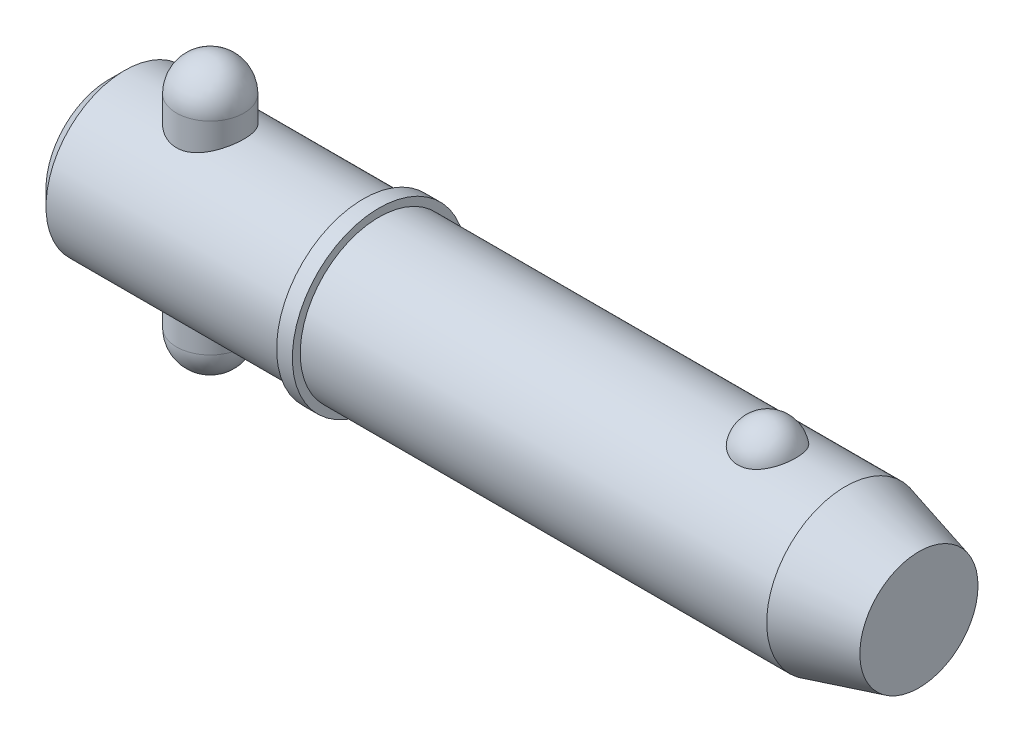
ISO-10303-21;
HEADER;
FILE_DESCRIPTION(('STEP AP214'),'2;1');
FILE_NAME('part.step','',(''),(''),'','','');
FILE_SCHEMA(('AUTOMOTIVE_DESIGN { 1 0 10303 214 1 1 1 1 }'));
ENDSEC;
DATA;
#1=APPLICATION_CONTEXT('core data for automotive mechanical design processes');
#2=APPLICATION_PROTOCOL_DEFINITION('international standard','automotive_design',2000,#1);
#3=PRODUCT_CONTEXT('',#1,'mechanical');
#4=PRODUCT('Part','Part','',(#3));
#5=PRODUCT_RELATED_PRODUCT_CATEGORY('part','',(#4));
#6=PRODUCT_DEFINITION_FORMATION('','',#4);
#7=PRODUCT_DEFINITION_CONTEXT('part definition',#1,'design');
#8=PRODUCT_DEFINITION('design','',#6,#7);
#9=PRODUCT_DEFINITION_SHAPE('','',#8);
#10=(LENGTH_UNIT() NAMED_UNIT(*) SI_UNIT(.MILLI.,.METRE.));
#11=(NAMED_UNIT(*) PLANE_ANGLE_UNIT() SI_UNIT($,.RADIAN.));
#12=(NAMED_UNIT(*) SI_UNIT($,.STERADIAN.) SOLID_ANGLE_UNIT());
#13=UNCERTAINTY_MEASURE_WITH_UNIT(LENGTH_MEASURE(1.E-05),#10,'distance_accuracy_value','');
#14=(GEOMETRIC_REPRESENTATION_CONTEXT(3) GLOBAL_UNCERTAINTY_ASSIGNED_CONTEXT((#13)) GLOBAL_UNIT_ASSIGNED_CONTEXT((#10,
#11,#12)) REPRESENTATION_CONTEXT('',''));
#15=CARTESIAN_POINT('',(0.,0.,0.));
#16=DIRECTION('',(0.,0.,1.));
#17=DIRECTION('',(1.,0.,0.));
#18=AXIS2_PLACEMENT_3D('',#15,#16,#17);
#19=CARTESIAN_POINT('',(14.28,19.05,0.));
#20=DIRECTION('',(0.,-1.,0.));
#21=DIRECTION('',(0.,0.,-1.));
#22=AXIS2_PLACEMENT_3D('',#19,#20,#21);
#23=CYLINDRICAL_SURFACE('',#22,4.76);
#24=CARTESIAN_POINT('',(14.28,-14.29,0.));
#25=DIRECTION('',(0.,-1.,0.));
#26=DIRECTION('',(0.,0.,-1.));
#27=AXIS2_PLACEMENT_3D('',#24,#25,#26);
#28=CIRCLE('',#27,4.76);
#29=CARTESIAN_POINT('',(14.28,-14.29,-4.76));
#30=VERTEX_POINT('',#29);
#31=EDGE_CURVE('P0_E10',#30,#30,#28,.F.);
#32=CARTESIAN_POINT('',(14.28,14.29,0.));
#33=DIRECTION('',(0.,-1.,0.));
#34=DIRECTION('',(0.,0.,-1.));
#35=AXIS2_PLACEMENT_3D('',#32,#33,#34);
#36=CIRCLE('',#35,4.76);
#37=CARTESIAN_POINT('',(14.28,14.29,-4.76));
#38=VERTEX_POINT('',#37);
#39=EDGE_CURVE('P0_E21',#38,#38,#36,.T.);
#40=CARTESIAN_POINT('',(14.28,-14.29,-4.76));
#41=CARTESIAN_POINT('',(14.28,-13.9922916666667,-4.76));
#42=CARTESIAN_POINT('',(14.28,-13.6945833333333,-4.76));
#43=CARTESIAN_POINT('',(14.28,-13.0991666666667,-4.76));
#44=CARTESIAN_POINT('',(14.28,-12.8014583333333,-4.76));
#45=CARTESIAN_POINT('',(14.28,-12.2060416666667,-4.76));
#46=CARTESIAN_POINT('',(14.28,-11.9083333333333,-4.76));
#47=CARTESIAN_POINT('',(14.28,-11.3129166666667,-4.76));
#48=CARTESIAN_POINT('',(14.28,-11.0152083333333,-4.76));
#49=CARTESIAN_POINT('',(14.28,-10.4197916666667,-4.76));
#50=CARTESIAN_POINT('',(14.28,-10.1220833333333,-4.76));
#51=CARTESIAN_POINT('',(14.28,-9.52666666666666,-4.76));
#52=CARTESIAN_POINT('',(14.28,-9.22895833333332,-4.76));
#53=CARTESIAN_POINT('',(14.28,-8.63354166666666,-4.76));
#54=CARTESIAN_POINT('',(14.28,-8.33583333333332,-4.76));
#55=CARTESIAN_POINT('',(14.28,-7.74041666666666,-4.76));
#56=CARTESIAN_POINT('',(14.28,-7.44270833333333,-4.76));
#57=CARTESIAN_POINT('',(14.28,-6.84729166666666,-4.76));
#58=CARTESIAN_POINT('',(14.28,-6.54958333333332,-4.76));
#59=CARTESIAN_POINT('',(14.28,-5.95416666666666,-4.76));
#60=CARTESIAN_POINT('',(14.28,-5.65645833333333,-4.76));
#61=CARTESIAN_POINT('',(14.28,-5.06104166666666,-4.76));
#62=CARTESIAN_POINT('',(14.28,-4.76333333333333,-4.76));
#63=CARTESIAN_POINT('',(14.28,-4.16791666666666,-4.76));
#64=CARTESIAN_POINT('',(14.28,-3.87020833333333,-4.76));
#65=CARTESIAN_POINT('',(14.28,-3.27479166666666,-4.76));
#66=CARTESIAN_POINT('',(14.28,-2.97708333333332,-4.76));
#67=CARTESIAN_POINT('',(14.28,-2.38166666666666,-4.76));
#68=CARTESIAN_POINT('',(14.28,-2.08395833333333,-4.76));
#69=CARTESIAN_POINT('',(14.28,-1.48854166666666,-4.76));
#70=CARTESIAN_POINT('',(14.28,-1.19083333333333,-4.76));
#71=CARTESIAN_POINT('',(14.28,-0.595416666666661,-4.76));
#72=CARTESIAN_POINT('',(14.28,-0.297708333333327,-4.76));
#73=CARTESIAN_POINT('',(14.28,0.297708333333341,-4.76));
#74=CARTESIAN_POINT('',(14.28,0.595416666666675,-4.76));
#75=CARTESIAN_POINT('',(14.28,1.19083333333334,-4.76));
#76=CARTESIAN_POINT('',(14.28,1.48854166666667,-4.76));
#77=CARTESIAN_POINT('',(14.28,2.08395833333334,-4.76));
#78=CARTESIAN_POINT('',(14.28,2.38166666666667,-4.76));
#79=CARTESIAN_POINT('',(14.28,2.97708333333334,-4.76));
#80=CARTESIAN_POINT('',(14.28,3.27479166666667,-4.76));
#81=CARTESIAN_POINT('',(14.28,3.87020833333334,-4.76));
#82=CARTESIAN_POINT('',(14.28,4.16791666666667,-4.76));
#83=CARTESIAN_POINT('',(14.28,4.76333333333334,-4.76));
#84=CARTESIAN_POINT('',(14.28,5.06104166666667,-4.76));
#85=CARTESIAN_POINT('',(14.28,5.65645833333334,-4.76));
#86=CARTESIAN_POINT('',(14.28,5.95416666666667,-4.76));
#87=CARTESIAN_POINT('',(14.28,6.54958333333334,-4.76));
#88=CARTESIAN_POINT('',(14.28,6.84729166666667,-4.76));
#89=CARTESIAN_POINT('',(14.28,7.44270833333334,-4.76));
#90=CARTESIAN_POINT('',(14.28,7.74041666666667,-4.76));
#91=CARTESIAN_POINT('',(14.28,8.33583333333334,-4.76));
#92=CARTESIAN_POINT('',(14.28,8.63354166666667,-4.76));
#93=CARTESIAN_POINT('',(14.28,9.22895833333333,-4.76));
#94=CARTESIAN_POINT('',(14.28,9.52666666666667,-4.76));
#95=CARTESIAN_POINT('',(14.28,10.1220833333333,-4.76));
#96=CARTESIAN_POINT('',(14.28,10.4197916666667,-4.76));
#97=CARTESIAN_POINT('',(14.28,11.0152083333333,-4.76));
#98=CARTESIAN_POINT('',(14.28,11.3129166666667,-4.76));
#99=CARTESIAN_POINT('',(14.28,11.9083333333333,-4.76));
#100=CARTESIAN_POINT('',(14.28,12.2060416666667,-4.76));
#101=CARTESIAN_POINT('',(14.28,12.8014583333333,-4.76));
#102=CARTESIAN_POINT('',(14.28,13.0991666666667,-4.76));
#103=CARTESIAN_POINT('',(14.28,13.6945833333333,-4.76));
#104=CARTESIAN_POINT('',(14.28,13.9922916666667,-4.76));
#105=CARTESIAN_POINT('',(14.28,14.29,-4.76));
#106=B_SPLINE_CURVE_WITH_KNOTS('',3,(#40,#41,#42,#43,#44,#45,#46,#47,#48,#49,#50,#51,#52,#53,
#54,#55,#56,#57,#58,#59,#60,#61,#62,#63,#64,#65,#66,#67,#68,#69,#70,#71,#72,#73,#74,#75,#76,#77,
#78,#79,#80,#81,#82,#83,#84,#85,#86,#87,#88,#89,#90,#91,#92,#93,#94,#95,#96,#97,#98,#99,#100,
#101,#102,#103,#104,#105),.UNSPECIFIED.,.F.,.F.,(4,2,2,2,2,2,2,2,2,2,2,2,2,2,2,2,2,2,2,2,2,2,2,
2,2,2,2,2,2,2,2,2,4),(0.,0.893125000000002,1.78625,2.67937499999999,3.5725,4.465625,5.35875,
6.25187499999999,7.145,8.038125,8.93125,9.82437499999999,10.7175,11.610625,12.50375,13.396875,
14.29,15.183125,16.07625,16.969375,17.8625,18.755625,19.64875,20.541875,21.435,22.328125,
23.22125,24.114375,25.0075,25.900625,26.79375,27.686875,28.58),.UNSPECIFIED.);
#107=EDGE_CURVE('P0_BSEAM14',#30,#38,#106,.T.);
#108=ORIENTED_EDGE('',*,*,#31,.T.);
#109=ORIENTED_EDGE('',*,*,#39,.T.);
#110=ORIENTED_EDGE('',*,*,#107,.T.);
#111=ORIENTED_EDGE('',*,*,#107,.F.);
#112=EDGE_LOOP('',(#108,#110,#109,#111));
#113=FACE_BOUND('',#112,.T.);
#114=ADVANCED_FACE('P0_F14',(#113),#23,.T.);
#115=CARTESIAN_POINT('',(14.28,-14.29,0.));
#116=DIRECTION('',(0.,0.,1.));
#117=DIRECTION('',(1.,0.,0.));
#118=AXIS2_PLACEMENT_3D('',#115,#116,#117);
#119=SPHERICAL_SURFACE('',#118,4.76);
#120=CARTESIAN_POINT('',(14.28,-14.29,0.));
#121=DIRECTION('',(0.,-1.,0.));
#122=DIRECTION('',(0.,0.,-1.));
#123=AXIS2_PLACEMENT_3D('',#120,#121,#122);
#124=SPHERICAL_SURFACE('',#123,4.76);
#125=ORIENTED_EDGE('',*,*,#31,.F.);
#126=EDGE_LOOP('',(#125));
#127=FACE_BOUND('',#126,.T.);
#128=ADVANCED_FACE('P0_F29',(#127),#124,.T.);
#129=CARTESIAN_POINT('',(14.28,14.29,0.));
#130=DIRECTION('',(0.,0.,1.));
#131=DIRECTION('',(1.,0.,0.));
#132=AXIS2_PLACEMENT_3D('',#129,#130,#131);
#133=SPHERICAL_SURFACE('',#132,4.76);
#134=CARTESIAN_POINT('',(14.28,14.29,0.));
#135=DIRECTION('',(0.,-1.,0.));
#136=DIRECTION('',(0.,0.,-1.));
#137=AXIS2_PLACEMENT_3D('',#134,#135,#136);
#138=SPHERICAL_SURFACE('',#137,4.76);
#139=ORIENTED_EDGE('',*,*,#39,.F.);
#140=EDGE_LOOP('',(#139));
#141=FACE_BOUND('',#140,.T.);
#142=ADVANCED_FACE('P0_F16',(#141),#138,.T.);
#143=CLOSED_SHELL('',(#114,#128,#142));
#144=MANIFOLD_SOLID_BREP('P0_B1',#143);
#145=CARTESIAN_POINT('',(0.,0.,0.));
#146=DIRECTION('',(1.,0.,0.));
#147=DIRECTION('',(0.,0.,-1.));
#148=AXIS2_PLACEMENT_3D('',#145,#146,#147);
#149=CYLINDRICAL_SURFACE('',#148,11.115);
#150=CARTESIAN_POINT('',(103.929563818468,0.,0.));
#151=DIRECTION('',(1.,0.,0.));
#152=DIRECTION('',(0.,0.,-1.));
#153=AXIS2_PLACEMENT_3D('',#150,#151,#152);
#154=CIRCLE('',#153,11.115);
#155=CARTESIAN_POINT('',(103.929563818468,0.,-11.115));
#156=VERTEX_POINT('',#155);
#157=EDGE_CURVE('P1_E81',#156,#156,#154,.T.);
#158=ORIENTED_EDGE('',*,*,#157,.F.);
#159=EDGE_LOOP('',(#158));
#160=FACE_BOUND('',#159,.T.);
#161=CARTESIAN_POINT('',(38.1,0.,0.));
#162=DIRECTION('',(1.,0.,0.));
#163=DIRECTION('',(0.,0.,-1.));
#164=AXIS2_PLACEMENT_3D('',#161,#162,#163);
#165=CIRCLE('',#164,11.115);
#166=CARTESIAN_POINT('',(38.1,0.,-11.115));
#167=VERTEX_POINT('',#166);
#168=EDGE_CURVE('P1_E85',#167,#167,#165,.T.);
#169=ORIENTED_EDGE('',*,*,#168,.T.);
#170=EDGE_LOOP('',(#169));
#171=FACE_BOUND('',#170,.T.);
#172=CARTESIAN_POINT('',(92.9310680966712,10.3028087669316,4.17077409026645));
#173=CARTESIAN_POINT('',(92.7147756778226,10.3028003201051,4.17078240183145));
#174=CARTESIAN_POINT('',(92.4985488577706,10.3098895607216,4.15340593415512));
#175=CARTESIAN_POINT('',(92.0725408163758,10.3373834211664,4.08449540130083));
#176=CARTESIAN_POINT('',(91.8627577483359,10.3577841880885,4.03297121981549));
#177=CARTESIAN_POINT('',(91.4557825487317,10.4095237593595,3.89746513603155));
#178=CARTESIAN_POINT('',(91.2585726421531,10.4408466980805,3.81353029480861));
#179=CARTESIAN_POINT('',(90.8813382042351,10.5110236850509,3.61560339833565));
#180=CARTESIAN_POINT('',(90.7013171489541,10.5498792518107,3.50160528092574));
#181=CARTESIAN_POINT('',(90.3576842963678,10.6322884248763,3.24292464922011));
#182=CARTESIAN_POINT('',(90.1946861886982,10.6759443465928,3.09746040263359));
#183=CARTESIAN_POINT('',(89.8945911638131,10.7625291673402,2.78171925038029));
#184=CARTESIAN_POINT('',(89.7574990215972,10.8054579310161,2.61143778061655));
#185=CARTESIAN_POINT('',(89.5064084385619,10.8881935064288,2.24226695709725));
#186=CARTESIAN_POINT('',(89.3937105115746,10.9277761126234,2.04244123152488));
#187=CARTESIAN_POINT('',(89.2017771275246,10.997484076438,1.62578254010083));
#188=CARTESIAN_POINT('',(89.1225446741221,11.0276085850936,1.40894804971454));
#189=CARTESIAN_POINT('',(88.9983034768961,11.0756732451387,0.961250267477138));
#190=CARTESIAN_POINT('',(88.953760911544,11.0934470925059,0.730239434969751));
#191=CARTESIAN_POINT('',(88.9015695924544,11.1143331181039,0.263439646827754));
#192=CARTESIAN_POINT('',(88.8939200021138,11.1174456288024,0.0276507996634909));
#193=CARTESIAN_POINT('',(88.9156105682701,11.1087161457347,-0.440729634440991));
#194=CARTESIAN_POINT('',(88.9447624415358,11.0969502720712,-0.673331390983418));
#195=CARTESIAN_POINT('',(89.0391432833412,11.0597872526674,-1.12996621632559));
#196=CARTESIAN_POINT('',(89.1043729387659,11.0343898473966,-1.35399912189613));
#197=CARTESIAN_POINT('',(89.2696984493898,10.972515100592,-1.78750286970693));
#198=CARTESIAN_POINT('',(89.3698386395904,10.9360236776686,-1.99695478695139));
#199=CARTESIAN_POINT('',(89.6029408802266,10.8557595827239,-2.3952066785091));
#200=CARTESIAN_POINT('',(89.7359054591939,10.8119863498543,-2.5840050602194));
#201=CARTESIAN_POINT('',(90.032407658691,10.7216733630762,-2.93635726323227));
#202=CARTESIAN_POINT('',(90.1960565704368,10.675123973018,-3.09981510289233));
#203=CARTESIAN_POINT('',(90.5498601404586,10.5846571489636,-3.39592247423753));
#204=CARTESIAN_POINT('',(90.7400123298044,10.5407394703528,-3.52857487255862));
#205=CARTESIAN_POINT('',(91.1375014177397,10.4616690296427,-3.75646057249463));
#206=CARTESIAN_POINT('',(91.3443670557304,10.4263443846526,-3.85245432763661));
#207=CARTESIAN_POINT('',(91.7729541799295,10.3675574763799,-4.00798747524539));
#208=CARTESIAN_POINT('',(91.994670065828,10.3440907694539,-4.06754052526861));
#209=CARTESIAN_POINT('',(92.4346695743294,10.3128282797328,-4.14614314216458));
#210=CARTESIAN_POINT('',(92.6525654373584,10.3043040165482,-4.1670783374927));
#211=CARTESIAN_POINT('',(93.08894951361,10.3016771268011,-4.17357158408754));
#212=CARTESIAN_POINT('',(93.3074376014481,10.3075716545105,-4.15913661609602));
#213=CARTESIAN_POINT('',(93.7317442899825,10.3326686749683,-4.09636961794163));
#214=CARTESIAN_POINT('',(93.9377458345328,10.3514555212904,-4.0490957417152));
#215=CARTESIAN_POINT('',(94.3385764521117,10.399818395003,-3.92320197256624));
#216=CARTESIAN_POINT('',(94.5334046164,10.4293952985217,-3.84457953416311));
#217=CARTESIAN_POINT('',(94.9111917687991,10.4969600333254,-3.65612410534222));
#218=CARTESIAN_POINT('',(95.0937974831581,10.5351178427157,-3.54564545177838));
#219=CARTESIAN_POINT('',(95.4382040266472,10.6154999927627,-3.29718036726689));
#220=CARTESIAN_POINT('',(95.600000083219,10.657725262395,-3.15918764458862));
#221=CARTESIAN_POINT('',(95.9069596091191,10.744212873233,-2.85163580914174));
#222=CARTESIAN_POINT('',(96.0508919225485,10.7884718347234,-2.68084605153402));
#223=CARTESIAN_POINT('',(96.3092371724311,10.872374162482,-2.3172186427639));
#224=CARTESIAN_POINT('',(96.4236448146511,10.9120167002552,-2.12437704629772));
#225=CARTESIAN_POINT('',(96.6238739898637,10.9838919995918,-1.71516999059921));
#226=CARTESIAN_POINT('',(96.7086617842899,11.0158465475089,-1.49824866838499));
#227=CARTESIAN_POINT('',(96.8426838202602,11.0673523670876,-1.05228572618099));
#228=CARTESIAN_POINT('',(96.8919174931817,11.086903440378,-0.823243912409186));
#229=CARTESIAN_POINT('',(96.9538915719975,11.1116323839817,-0.359087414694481));
#230=CARTESIAN_POINT('',(96.9665662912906,11.1167843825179,-0.123962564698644));
#231=CARTESIAN_POINT('',(96.954973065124,11.1121144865,0.345220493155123));
#232=CARTESIAN_POINT('',(96.9307056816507,11.1022928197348,0.579278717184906));
#233=CARTESIAN_POINT('',(96.8459073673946,11.0687504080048,1.03866534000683));
#234=CARTESIAN_POINT('',(96.7855299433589,11.0450885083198,1.26402641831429));
#235=CARTESIAN_POINT('',(96.6298532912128,10.9863185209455,1.70076772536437));
#236=CARTESIAN_POINT('',(96.534551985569,10.9512097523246,1.91214712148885));
#237=CARTESIAN_POINT('',(96.3103974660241,10.8729733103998,2.31608359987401));
#238=CARTESIAN_POINT('',(96.1813806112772,10.8298068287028,2.50854240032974));
#239=CARTESIAN_POINT('',(95.8927327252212,10.7401896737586,2.86808766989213));
#240=CARTESIAN_POINT('',(95.7331022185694,10.6937390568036,3.03517457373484));
#241=CARTESIAN_POINT('',(95.3875341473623,10.6029321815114,3.33857581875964));
#242=CARTESIAN_POINT('',(95.2017089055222,10.5585680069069,3.47501541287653));
#243=CARTESIAN_POINT('',(94.8078750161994,10.4769321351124,3.71390897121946));
#244=CARTESIAN_POINT('',(94.5998635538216,10.439661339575,3.81635861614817));
#245=CARTESIAN_POINT('',(94.1540666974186,10.3749407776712,3.98910631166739));
#246=CARTESIAN_POINT('',(93.9152342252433,10.3482457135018,4.05700929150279));
#247=CARTESIAN_POINT('',(93.4279254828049,10.312188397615,4.14782844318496));
#248=CARTESIAN_POINT('',(93.1794535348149,10.3028184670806,4.17076454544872));
#249=CARTESIAN_POINT('',(92.9310680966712,10.3028087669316,4.17077409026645));
#250=B_SPLINE_CURVE_WITH_KNOTS('',3,(#172,#173,#174,#175,#176,#177,#178,#179,#180,#181,#182,
#183,#184,#185,#186,#187,#188,#189,#190,#191,#192,#193,#194,#195,#196,#197,#198,#199,#200,#201,
#202,#203,#204,#205,#206,#207,#208,#209,#210,#211,#212,#213,#214,#215,#216,#217,#218,#219,#220,
#221,#222,#223,#224,#225,#226,#227,#228,#229,#230,#231,#232,#233,#234,#235,#236,#237,#238,#239,
#240,#241,#242,#243,#244,#245,#246,#247,#248,#249),.UNSPECIFIED.,.T.,.F.,(4,2,2,2,2,2,2,2,2,2,2,
2,2,2,2,2,2,2,2,2,2,2,2,2,2,2,2,2,2,2,2,2,2,2,2,2,2,2,4),(0.,0.647966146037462,1.29574482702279,
1.94258643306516,2.58955857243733,3.25496465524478,3.92049326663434,4.61566368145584,
5.31089647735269,6.01531821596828,6.71972398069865,7.42054043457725,8.12137023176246,
8.82309331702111,9.52487047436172,10.2292439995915,10.9335519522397,11.6223330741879,
12.3108558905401,12.9647664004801,13.6185478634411,14.2521847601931,14.8858731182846,
15.5334360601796,16.1811472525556,16.8611459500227,17.5412664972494,18.2431855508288,
18.9451158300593,19.6483065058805,20.3514864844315,21.0516982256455,21.7519516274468,
22.4556690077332,23.1593743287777,23.8601491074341,24.5610129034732,25.3054529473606,
26.049562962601),.UNSPECIFIED.);
#251=CARTESIAN_POINT('',(92.9310680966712,10.3028087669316,4.17077409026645));
#252=VERTEX_POINT('',#251);
#253=EDGE_CURVE('P1_E35',#252,#252,#250,.T.);
#254=ORIENTED_EDGE('',*,*,#253,.T.);
#255=EDGE_LOOP('',(#254));
#256=FACE_BOUND('',#255,.T.);
#257=ADVANCED_FACE('P1_F13',(#160,#171,#256),#149,.T.);
#258=CARTESIAN_POINT('',(0.,0.,0.));
#259=DIRECTION('',(-1.,0.,0.));
#260=DIRECTION('',(0.,0.,1.));
#261=AXIS2_PLACEMENT_3D('',#258,#259,#260);
#262=PLANE('',#261);
#263=CARTESIAN_POINT('',(0.,0.,0.));
#264=DIRECTION('',(1.,0.,0.));
#265=DIRECTION('',(0.,0.,-1.));
#266=AXIS2_PLACEMENT_3D('',#263,#264,#265);
#267=CIRCLE('',#266,8.892);
#268=CARTESIAN_POINT('',(0.,0.,-8.892));
#269=VERTEX_POINT('',#268);
#270=EDGE_CURVE('P1_E9',#269,#269,#267,.T.);
#271=ORIENTED_EDGE('',*,*,#270,.F.);
#272=EDGE_LOOP('',(#271));
#273=FACE_BOUND('',#272,.T.);
#274=ADVANCED_FACE('P1_F15',(#273),#262,.T.);
#275=CARTESIAN_POINT('',(2.22299999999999,0.,0.));
#276=DIRECTION('',(1.,0.,0.));
#277=DIRECTION('',(0.,0.,-1.));
#278=AXIS2_PLACEMENT_3D('',#275,#276,#277);
#279=CONICAL_SURFACE('',#278,11.115,0.78539816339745);
#280=ORIENTED_EDGE('',*,*,#270,.T.);
#281=EDGE_LOOP('',(#280));
#282=FACE_BOUND('',#281,.T.);
#283=CARTESIAN_POINT('',(2.22299999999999,0.,0.));
#284=DIRECTION('',(1.,0.,0.));
#285=DIRECTION('',(0.,0.,-1.));
#286=AXIS2_PLACEMENT_3D('',#283,#284,#285);
#287=CIRCLE('',#286,11.115);
#288=CARTESIAN_POINT('',(2.22299999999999,0.,-11.115));
#289=VERTEX_POINT('',#288);
#290=EDGE_CURVE('P1_E26',#289,#289,#287,.T.);
#291=ORIENTED_EDGE('',*,*,#290,.F.);
#292=EDGE_LOOP('',(#291));
#293=FACE_BOUND('',#292,.T.);
#294=ADVANCED_FACE('P1_F77',(#282,#293),#279,.T.);
#295=CARTESIAN_POINT('',(0.,0.,0.));
#296=DIRECTION('',(1.,0.,0.));
#297=DIRECTION('',(0.,0.,-1.));
#298=AXIS2_PLACEMENT_3D('',#295,#296,#297);
#299=CYLINDRICAL_SURFACE('',#298,11.115);
#300=CARTESIAN_POINT('',(14.28,-10.0441836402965,4.76));
#301=CARTESIAN_POINT('',(14.1533731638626,-10.0441846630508,4.75999904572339));
#302=CARTESIAN_POINT('',(14.0267055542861,-10.0465865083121,4.75493985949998));
#303=CARTESIAN_POINT('',(13.774298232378,-10.0561141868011,4.73475585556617));
#304=CARTESIAN_POINT('',(13.6485591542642,-10.0632429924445,4.71962470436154));
#305=CARTESIAN_POINT('',(13.3987500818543,-10.0819979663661,4.67942666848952));
#306=CARTESIAN_POINT('',(13.2746840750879,-10.0936334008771,4.65433930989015));
#307=CARTESIAN_POINT('',(13.0293244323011,-10.1210146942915,4.59449317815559));
#308=CARTESIAN_POINT('',(12.9080319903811,-10.1367622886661,4.55973032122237));
#309=CARTESIAN_POINT('',(12.669614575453,-10.1717810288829,4.48106435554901));
#310=CARTESIAN_POINT('',(12.5524727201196,-10.1910352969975,4.4372048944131));
#311=CARTESIAN_POINT('',(12.3224300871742,-10.2325403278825,4.34063417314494));
#312=CARTESIAN_POINT('',(12.2095309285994,-10.2547922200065,4.28791957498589));
#313=CARTESIAN_POINT('',(11.8782785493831,-10.3250879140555,4.11715127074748));
#314=CARTESIAN_POINT('',(11.6670799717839,-10.3767168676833,3.98637638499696));
#315=CARTESIAN_POINT('',(11.2564039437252,-10.4874309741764,3.68567149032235));
#316=CARTESIAN_POINT('',(11.0583793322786,-10.5467772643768,3.51386978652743));
#317=CARTESIAN_POINT('',(10.6927724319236,-10.6641377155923,3.13969960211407));
#318=CARTESIAN_POINT('',(10.5252022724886,-10.7221513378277,2.93731900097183));
#319=CARTESIAN_POINT('',(10.2965609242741,-10.8050020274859,2.60935726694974));
#320=CARTESIAN_POINT('',(10.2227768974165,-10.8324811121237,2.49310321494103));
#321=CARTESIAN_POINT('',(10.0853380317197,-10.884703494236,2.25418999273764));
#322=CARTESIAN_POINT('',(10.0216789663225,-10.9094479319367,2.13153352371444));
#323=CARTESIAN_POINT('',(9.90506238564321,-10.9554932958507,1.88060370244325));
#324=CARTESIAN_POINT('',(9.85210574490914,-10.9767939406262,1.7523298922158));
#325=CARTESIAN_POINT('',(9.75746464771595,-11.0153112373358,1.49115740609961));
#326=CARTESIAN_POINT('',(9.71577447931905,-11.0325299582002,1.35826111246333));
#327=CARTESIAN_POINT('',(9.64605475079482,-11.0615607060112,1.09614539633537));
#328=CARTESIAN_POINT('',(9.61740732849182,-11.0736151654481,0.96711700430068));
#329=CARTESIAN_POINT('',(9.57092026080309,-11.0932687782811,0.706847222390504));
#330=CARTESIAN_POINT('',(9.55307574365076,-11.1008699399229,0.575606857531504));
#331=CARTESIAN_POINT('',(9.52838640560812,-11.1114054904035,0.31192917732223));
#332=CARTESIAN_POINT('',(9.52153986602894,-11.114340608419,0.179492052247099));
#333=CARTESIAN_POINT('',(9.51892405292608,-11.1154607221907,-0.0855090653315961));
#334=CARTESIAN_POINT('',(9.52315432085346,-11.1136459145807,-0.218073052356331));
#335=CARTESIAN_POINT('',(9.542009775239,-11.1055891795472,-0.473709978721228));
#336=CARTESIAN_POINT('',(9.55594693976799,-11.099640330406,-0.596843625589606));
#337=CARTESIAN_POINT('',(9.59332832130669,-11.0837823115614,-0.841440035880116));
#338=CARTESIAN_POINT('',(9.61677567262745,-11.0738718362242,-0.962902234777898));
#339=CARTESIAN_POINT('',(9.67294089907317,-11.0503378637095,-1.20325684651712));
#340=CARTESIAN_POINT('',(9.70565569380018,-11.0367156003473,-1.32215009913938));
#341=CARTESIAN_POINT('',(9.78005008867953,-11.0060908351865,-1.55666640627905));
#342=CARTESIAN_POINT('',(9.82173311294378,-10.9890870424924,-1.67228819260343));
#343=CARTESIAN_POINT('',(9.96110379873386,-10.9330280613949,-2.01656166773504));
#344=CARTESIAN_POINT('',(10.0722987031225,-10.8892801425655,-2.23915547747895));
#345=CARTESIAN_POINT('',(10.3268588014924,-10.7934745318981,-2.66299199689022));
#346=CARTESIAN_POINT('',(10.4702355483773,-10.7414138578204,-2.86422700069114));
#347=CARTESIAN_POINT('',(10.7973904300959,-10.6296201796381,-3.25557775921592));
#348=CARTESIAN_POINT('',(10.9833705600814,-10.569604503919,-3.443774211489));
#349=CARTESIAN_POINT('',(11.3844486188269,-10.4514707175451,-3.78722133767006));
#350=CARTESIAN_POINT('',(11.5995590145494,-10.3933534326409,-3.94245783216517));
#351=CARTESIAN_POINT('',(11.9444340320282,-10.311516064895,-4.14990014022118));
#352=CARTESIAN_POINT('',(12.0654579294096,-10.2847012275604,-4.21573894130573));
#353=CARTESIAN_POINT('',(12.3132718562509,-10.2342051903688,-4.33688518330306));
#354=CARTESIAN_POINT('',(12.4400593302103,-10.2105226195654,-4.39219723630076));
#355=CARTESIAN_POINT('',(12.6985418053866,-10.1671237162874,-4.49174500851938));
#356=CARTESIAN_POINT('',(12.8302359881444,-10.1474067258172,-4.53598256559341));
#357=CARTESIAN_POINT('',(13.0975061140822,-10.1126841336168,-4.61287629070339));
#358=CARTESIAN_POINT('',(13.233079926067,-10.0976759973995,-4.64553869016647));
#359=CARTESIAN_POINT('',(13.4978553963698,-10.0737863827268,-4.6971059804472));
#360=CARTESIAN_POINT('',(13.6268754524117,-10.0645618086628,-4.716785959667));
#361=CARTESIAN_POINT('',(13.8862990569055,-10.051062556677,-4.74548419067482));
#362=CARTESIAN_POINT('',(14.0167019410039,-10.0467856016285,-4.75450734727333));
#363=CARTESIAN_POINT('',(14.277859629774,-10.0433352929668,-4.76179143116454));
#364=CARTESIAN_POINT('',(14.4086143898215,-10.0441613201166,-4.76005366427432));
#365=CARTESIAN_POINT('',(14.6694025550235,-10.0508838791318,-4.74584231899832));
#366=CARTESIAN_POINT('',(14.7994359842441,-10.0567802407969,-4.73336910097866));
#367=CARTESIAN_POINT('',(15.0487369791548,-10.0728449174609,-4.69907984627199));
#368=CARTESIAN_POINT('',(15.1681238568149,-10.0826872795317,-4.67797462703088));
#369=CARTESIAN_POINT('',(15.4045894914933,-10.1062580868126,-4.62682977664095));
#370=CARTESIAN_POINT('',(15.5216674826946,-10.1199877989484,-4.59678723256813));
#371=CARTESIAN_POINT('',(15.868278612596,-10.1664161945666,-4.49365911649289));
#372=CARTESIAN_POINT('',(16.0933756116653,-10.2043671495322,-4.40754694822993));
#373=CARTESIAN_POINT('',(16.5357981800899,-10.2919879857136,-4.19898201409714));
#374=CARTESIAN_POINT('',(16.7523611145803,-10.3420954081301,-4.07511281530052));
#375=CARTESIAN_POINT('',(17.1627188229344,-10.4477911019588,-3.7959429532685));
#376=CARTESIAN_POINT('',(17.3565033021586,-10.5033818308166,-3.64062816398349));
#377=CARTESIAN_POINT('',(17.7334034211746,-10.6196376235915,-3.28693729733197));
#378=CARTESIAN_POINT('',(17.9141276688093,-10.6803237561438,-3.08599175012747));
#379=CARTESIAN_POINT('',(18.1582189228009,-10.7666348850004,-2.76320365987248));
#380=CARTESIAN_POINT('',(18.2351223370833,-10.7946346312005,-2.65197124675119));
#381=CARTESIAN_POINT('',(18.3793967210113,-10.8483267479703,-2.42297927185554));
#382=CARTESIAN_POINT('',(18.4467718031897,-10.87402011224,-2.30522255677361));
#383=CARTESIAN_POINT('',(18.5717669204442,-10.9225249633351,-2.06324665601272));
#384=CARTESIAN_POINT('',(18.6293326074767,-10.9453202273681,-1.93899615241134));
#385=CARTESIAN_POINT('',(18.73370006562,-10.9872100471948,-1.6855059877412));
#386=CARTESIAN_POINT('',(18.7805065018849,-11.0063062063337,-1.55626851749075));
#387=CARTESIAN_POINT('',(18.8628731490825,-11.0402419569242,-1.29375150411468));
#388=CARTESIAN_POINT('',(18.8984366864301,-11.0550828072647,-1.16047316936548));
#389=CARTESIAN_POINT('',(18.9579183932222,-11.0800638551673,-0.890912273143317));
#390=CARTESIAN_POINT('',(18.9818374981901,-11.0902044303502,-0.75462995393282));
#391=CARTESIAN_POINT('',(19.0164177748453,-11.104911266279,-0.490295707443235));
#392=CARTESIAN_POINT('',(19.027922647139,-11.1098318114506,-0.362373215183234));
#393=CARTESIAN_POINT('',(19.040554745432,-11.1152360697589,-0.105876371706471));
#394=CARTESIAN_POINT('',(19.0416784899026,-11.1157182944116,0.0226981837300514));
#395=CARTESIAN_POINT('',(19.0335275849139,-11.1122291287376,0.27938352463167));
#396=CARTESIAN_POINT('',(19.0242587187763,-11.1082602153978,0.407494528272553));
#397=CARTESIAN_POINT('',(18.9954320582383,-11.0959792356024,0.662388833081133));
#398=CARTESIAN_POINT('',(18.9758704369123,-11.0876655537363,0.789171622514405));
#399=CARTESIAN_POINT('',(18.9276379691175,-11.0673259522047,1.03545890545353));
#400=CARTESIAN_POINT('',(18.8993573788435,-11.0554596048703,1.15505309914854));
#401=CARTESIAN_POINT('',(18.8337694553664,-11.0282166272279,1.39134516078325));
#402=CARTESIAN_POINT('',(18.7964589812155,-11.0128387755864,1.5080420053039));
#403=CARTESIAN_POINT('',(18.671464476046,-10.9619666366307,1.85262797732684));
#404=CARTESIAN_POINT('',(18.5706772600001,-10.9217161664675,2.07521484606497));
#405=CARTESIAN_POINT('',(18.33202463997,-10.8301378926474,2.51061719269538));
#406=CARTESIAN_POINT('',(18.1926775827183,-10.7783885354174,2.72252375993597));
#407=CARTESIAN_POINT('',(17.8829747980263,-10.669863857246,3.12088015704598));
#408=CARTESIAN_POINT('',(17.7126068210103,-10.6130865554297,3.30731987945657));
#409=CARTESIAN_POINT('',(17.3310036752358,-10.495668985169,3.66358491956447));
#410=CARTESIAN_POINT('',(17.1177010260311,-10.4350471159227,3.83122543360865));
#411=CARTESIAN_POINT('',(16.7778915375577,-10.3495418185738,4.05420569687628));
#412=CARTESIAN_POINT('',(16.6612023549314,-10.3219229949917,4.12383380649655));
#413=CARTESIAN_POINT('',(16.4218466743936,-10.2693487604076,4.25306463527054));
#414=CARTESIAN_POINT('',(16.2991829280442,-10.2443921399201,4.31267191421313));
#415=CARTESIAN_POINT('',(16.0488008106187,-10.1979981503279,4.42126071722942));
#416=CARTESIAN_POINT('',(15.9210894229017,-10.1765561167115,4.47025635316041));
#417=CARTESIAN_POINT('',(15.6613937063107,-10.1379191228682,4.55720152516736));
#418=CARTESIAN_POINT('',(15.5294115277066,-10.1207220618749,4.59515652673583));
#419=CARTESIAN_POINT('',(15.2624981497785,-10.091252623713,4.65951684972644));
#420=CARTESIAN_POINT('',(15.1275757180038,-10.0789672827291,4.68595259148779));
#421=CARTESIAN_POINT('',(14.8556442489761,-10.0597530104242,4.72706206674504));
#422=CARTESIAN_POINT('',(14.7186368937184,-10.0528199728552,4.74174481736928));
#423=CARTESIAN_POINT('',(14.5310955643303,-10.047196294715,4.75363843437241));
#424=CARTESIAN_POINT('',(14.48091543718,-10.0460674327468,4.75602323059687));
#425=CARTESIAN_POINT('',(14.3804923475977,-10.044560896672,4.7592042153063));
#426=CARTESIAN_POINT('',(14.3302493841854,-10.0441832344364,4.76000037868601));
#427=CARTESIAN_POINT('',(14.28,-10.0441836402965,4.76));
#428=B_SPLINE_CURVE_WITH_KNOTS('',3,(#300,#301,#302,#303,#304,#305,#306,#307,#308,#309,#310,
#311,#312,#313,#314,#315,#316,#317,#318,#319,#320,#321,#322,#323,#324,#325,#326,#327,#328,#329,
#330,#331,#332,#333,#334,#335,#336,#337,#338,#339,#340,#341,#342,#343,#344,#345,#346,#347,#348,
#349,#350,#351,#352,#353,#354,#355,#356,#357,#358,#359,#360,#361,#362,#363,#364,#365,#366,#367,
#368,#369,#370,#371,#372,#373,#374,#375,#376,#377,#378,#379,#380,#381,#382,#383,#384,#385,#386,
#387,#388,#389,#390,#391,#392,#393,#394,#395,#396,#397,#398,#399,#400,#401,#402,#403,#404,#405,
#406,#407,#408,#409,#410,#411,#412,#413,#414,#415,#416,#417,#418,#419,#420,#421,#422,#423,#424,
#425,#426,#427),.UNSPECIFIED.,.T.,.F.,(4,2,2,2,2,2,2,2,2,2,2,2,2,2,2,2,2,2,2,2,2,2,2,2,2,2,2,2,
2,2,2,2,2,2,2,2,2,2,2,2,2,2,2,2,2,2,2,2,2,2,2,2,2,2,2,2,2,2,2,2,2,2,2,4),(0.,0.379828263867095,
0.759895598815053,1.14074858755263,1.52176256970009,1.90098898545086,2.28035867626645,
3.03818035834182,3.84125131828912,4.6446414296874,5.06541657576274,5.48601561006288,
5.90664899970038,6.3270687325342,6.72470503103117,7.12216187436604,7.51955659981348,
7.91693487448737,8.28868404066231,8.66055582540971,9.03230414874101,9.40419465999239,
10.1585834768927,10.9132435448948,11.7236471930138,12.5343987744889,12.9550196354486,
13.3754557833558,13.7958221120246,14.2159617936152,14.6079540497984,14.9997658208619,
15.3915300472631,15.7832811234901,16.1477615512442,16.512360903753,17.240999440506,
18.0012974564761,18.761937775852,19.5886929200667,20.0025782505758,20.4162843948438,
20.832212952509,21.2479608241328,21.6635855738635,22.0791769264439,22.4642880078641,
22.8495282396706,23.2345541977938,23.6197234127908,23.9896813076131,24.3597680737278,
25.099327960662,25.8726239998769,26.6462260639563,27.4759193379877,27.8914891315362,
28.3068693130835,28.7216936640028,29.1363123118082,29.5498292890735,29.9630287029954,
30.113753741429,30.2644811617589),.UNSPECIFIED.);
#429=CARTESIAN_POINT('',(14.28,-10.0441836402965,4.76));
#430=VERTEX_POINT('',#429);
#431=EDGE_CURVE('P1_E17',#430,#430,#428,.T.);
#432=ORIENTED_EDGE('',*,*,#431,.F.);
#433=EDGE_LOOP('',(#432));
#434=FACE_BOUND('',#433,.T.);
#435=CARTESIAN_POINT('',(14.28,10.0441836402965,4.76));
#436=CARTESIAN_POINT('',(14.4066268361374,10.0441846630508,4.75999904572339));
#437=CARTESIAN_POINT('',(14.5332944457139,10.0465865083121,4.75493985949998));
#438=CARTESIAN_POINT('',(14.785701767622,10.0561141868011,4.73475585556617));
#439=CARTESIAN_POINT('',(14.9114408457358,10.0632429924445,4.71962470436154));
#440=CARTESIAN_POINT('',(15.1612499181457,10.0819979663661,4.67942666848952));
#441=CARTESIAN_POINT('',(15.2853159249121,10.0936334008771,4.65433930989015));
#442=CARTESIAN_POINT('',(15.5306755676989,10.1210146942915,4.59449317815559));
#443=CARTESIAN_POINT('',(15.6519680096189,10.1367622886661,4.55973032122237));
#444=CARTESIAN_POINT('',(15.890385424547,10.1717810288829,4.48106435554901));
#445=CARTESIAN_POINT('',(16.0075272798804,10.1910352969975,4.4372048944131));
#446=CARTESIAN_POINT('',(16.2375699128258,10.2325403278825,4.34063417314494));
#447=CARTESIAN_POINT('',(16.3504690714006,10.2547922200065,4.28791957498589));
#448=CARTESIAN_POINT('',(16.6817214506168,10.3250879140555,4.11715127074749));
#449=CARTESIAN_POINT('',(16.8929200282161,10.3767168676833,3.98637638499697));
#450=CARTESIAN_POINT('',(17.3035960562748,10.4874309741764,3.68567149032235));
#451=CARTESIAN_POINT('',(17.5016206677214,10.5467772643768,3.51386978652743));
#452=CARTESIAN_POINT('',(17.8672275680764,10.6641377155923,3.13969960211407));
#453=CARTESIAN_POINT('',(18.0347977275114,10.7221513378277,2.93731900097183));
#454=CARTESIAN_POINT('',(18.2634390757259,10.8050020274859,2.60935726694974));
#455=CARTESIAN_POINT('',(18.3372231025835,10.8324811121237,2.49310321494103));
#456=CARTESIAN_POINT('',(18.4746619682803,10.884703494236,2.25418999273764));
#457=CARTESIAN_POINT('',(18.5383210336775,10.9094479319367,2.13153352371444));
#458=CARTESIAN_POINT('',(18.6549376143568,10.9554932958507,1.88060370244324));
#459=CARTESIAN_POINT('',(18.7078942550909,10.9767939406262,1.75232989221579));
#460=CARTESIAN_POINT('',(18.8025353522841,11.0153112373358,1.4911574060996));
#461=CARTESIAN_POINT('',(18.844225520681,11.0325299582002,1.35826111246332));
#462=CARTESIAN_POINT('',(18.9139452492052,11.0615607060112,1.09614539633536));
#463=CARTESIAN_POINT('',(18.9425926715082,11.0736151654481,0.967117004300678));
#464=CARTESIAN_POINT('',(18.9890797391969,11.0932687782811,0.706847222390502));
#465=CARTESIAN_POINT('',(19.0069242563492,11.1008699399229,0.575606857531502));
#466=CARTESIAN_POINT('',(19.0316135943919,11.1114054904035,0.311929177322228));
#467=CARTESIAN_POINT('',(19.0384601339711,11.114340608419,0.179492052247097));
#468=CARTESIAN_POINT('',(19.0410759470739,11.1154607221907,-0.0855090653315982));
#469=CARTESIAN_POINT('',(19.0368456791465,11.1136459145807,-0.218073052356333));
#470=CARTESIAN_POINT('',(19.017990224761,11.1055891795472,-0.47370997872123));
#471=CARTESIAN_POINT('',(19.004053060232,11.099640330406,-0.596843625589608));
#472=CARTESIAN_POINT('',(18.9666716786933,11.0837823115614,-0.841440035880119));
#473=CARTESIAN_POINT('',(18.9432243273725,11.0738718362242,-0.9629022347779));
#474=CARTESIAN_POINT('',(18.8870591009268,11.0503378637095,-1.20325684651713));
#475=CARTESIAN_POINT('',(18.8543443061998,11.0367156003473,-1.32215009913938));
#476=CARTESIAN_POINT('',(18.7799499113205,11.0060908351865,-1.55666640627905));
#477=CARTESIAN_POINT('',(18.7382668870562,10.9890870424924,-1.67228819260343));
#478=CARTESIAN_POINT('',(18.5988962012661,10.9330280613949,-2.01656166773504));
#479=CARTESIAN_POINT('',(18.4877012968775,10.8892801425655,-2.23915547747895));
#480=CARTESIAN_POINT('',(18.2331411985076,10.7934745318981,-2.66299199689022));
#481=CARTESIAN_POINT('',(18.0897644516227,10.7414138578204,-2.86422700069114));
#482=CARTESIAN_POINT('',(17.7626095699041,10.6296201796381,-3.25557775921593));
#483=CARTESIAN_POINT('',(17.5766294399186,10.569604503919,-3.443774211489));
#484=CARTESIAN_POINT('',(17.1755513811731,10.4514707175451,-3.78722133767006));
#485=CARTESIAN_POINT('',(16.9604409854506,10.3933534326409,-3.94245783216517));
#486=CARTESIAN_POINT('',(16.6155659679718,10.311516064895,-4.14990014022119));
#487=CARTESIAN_POINT('',(16.4945420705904,10.2847012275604,-4.21573894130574));
#488=CARTESIAN_POINT('',(16.2467281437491,10.2342051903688,-4.33688518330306));
#489=CARTESIAN_POINT('',(16.1199406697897,10.2105226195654,-4.39219723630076));
#490=CARTESIAN_POINT('',(15.8614581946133,10.1671237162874,-4.49174500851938));
#491=CARTESIAN_POINT('',(15.7297640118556,10.1474067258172,-4.53598256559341));
#492=CARTESIAN_POINT('',(15.4624938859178,10.1126841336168,-4.61287629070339));
#493=CARTESIAN_POINT('',(15.326920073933,10.0976759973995,-4.64553869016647));
#494=CARTESIAN_POINT('',(15.0621446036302,10.0737863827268,-4.6971059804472));
#495=CARTESIAN_POINT('',(14.9331245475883,10.0645618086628,-4.716785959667));
#496=CARTESIAN_POINT('',(14.6737009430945,10.051062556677,-4.74548419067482));
#497=CARTESIAN_POINT('',(14.543298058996,10.0467856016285,-4.75450734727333));
#498=CARTESIAN_POINT('',(14.2821403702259,10.0433352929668,-4.76179143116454));
#499=CARTESIAN_POINT('',(14.1513856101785,10.0441613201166,-4.76005366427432));
#500=CARTESIAN_POINT('',(13.8905974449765,10.0508838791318,-4.74584231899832));
#501=CARTESIAN_POINT('',(13.7605640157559,10.0567802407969,-4.73336910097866));
#502=CARTESIAN_POINT('',(13.5112630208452,10.0728449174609,-4.69907984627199));
#503=CARTESIAN_POINT('',(13.3918761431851,10.0826872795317,-4.67797462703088));
#504=CARTESIAN_POINT('',(13.1554105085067,10.1062580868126,-4.62682977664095));
#505=CARTESIAN_POINT('',(13.0383325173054,10.1199877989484,-4.59678723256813));
#506=CARTESIAN_POINT('',(12.691721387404,10.1664161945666,-4.49365911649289));
#507=CARTESIAN_POINT('',(12.4666243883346,10.2043671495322,-4.40754694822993));
#508=CARTESIAN_POINT('',(12.0242018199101,10.2919879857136,-4.19898201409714));
#509=CARTESIAN_POINT('',(11.8076388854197,10.3420954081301,-4.07511281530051));
#510=CARTESIAN_POINT('',(11.3972811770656,10.4477911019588,-3.7959429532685));
#511=CARTESIAN_POINT('',(11.2034966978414,10.5033818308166,-3.64062816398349));
#512=CARTESIAN_POINT('',(10.8265965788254,10.6196376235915,-3.28693729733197));
#513=CARTESIAN_POINT('',(10.6458723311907,10.6803237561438,-3.08599175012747));
#514=CARTESIAN_POINT('',(10.4017810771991,10.7666348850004,-2.76320365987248));
#515=CARTESIAN_POINT('',(10.3248776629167,10.7946346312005,-2.65197124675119));
#516=CARTESIAN_POINT('',(10.1806032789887,10.8483267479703,-2.42297927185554));
#517=CARTESIAN_POINT('',(10.1132281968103,10.87402011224,-2.30522255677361));
#518=CARTESIAN_POINT('',(9.98823307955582,10.9225249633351,-2.06324665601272));
#519=CARTESIAN_POINT('',(9.93066739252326,10.9453202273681,-1.93899615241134));
#520=CARTESIAN_POINT('',(9.82629993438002,10.9872100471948,-1.6855059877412));
#521=CARTESIAN_POINT('',(9.77949349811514,11.0063062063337,-1.55626851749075));
#522=CARTESIAN_POINT('',(9.69712685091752,11.0402419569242,-1.29375150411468));
#523=CARTESIAN_POINT('',(9.66156331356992,11.0550828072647,-1.16047316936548));
#524=CARTESIAN_POINT('',(9.60208160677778,11.0800638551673,-0.890912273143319));
#525=CARTESIAN_POINT('',(9.57816250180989,11.0902044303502,-0.754629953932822));
#526=CARTESIAN_POINT('',(9.54358222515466,11.104911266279,-0.490295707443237));
#527=CARTESIAN_POINT('',(9.53207735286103,11.1098318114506,-0.362373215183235));
#528=CARTESIAN_POINT('',(9.51944525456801,11.1152360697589,-0.105876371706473));
#529=CARTESIAN_POINT('',(9.51832151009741,11.1157182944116,0.0226981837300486));
#530=CARTESIAN_POINT('',(9.52647241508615,11.1122291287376,0.279383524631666));
#531=CARTESIAN_POINT('',(9.53574128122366,11.1082602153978,0.407494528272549));
#532=CARTESIAN_POINT('',(9.5645679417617,11.0959792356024,0.662388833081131));
#533=CARTESIAN_POINT('',(9.58412956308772,11.0876655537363,0.789171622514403));
#534=CARTESIAN_POINT('',(9.63236203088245,11.0673259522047,1.03545890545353));
#535=CARTESIAN_POINT('',(9.66064262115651,11.0554596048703,1.15505309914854));
#536=CARTESIAN_POINT('',(9.72623054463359,11.0282166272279,1.39134516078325));
#537=CARTESIAN_POINT('',(9.76354101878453,11.0128387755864,1.5080420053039));
#538=CARTESIAN_POINT('',(9.88853552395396,10.9619666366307,1.85262797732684));
#539=CARTESIAN_POINT('',(9.98932273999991,10.9217161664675,2.07521484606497));
#540=CARTESIAN_POINT('',(10.22797536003,10.8301378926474,2.51061719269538));
#541=CARTESIAN_POINT('',(10.3673224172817,10.7783885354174,2.72252375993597));
#542=CARTESIAN_POINT('',(10.6770252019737,10.669863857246,3.12088015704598));
#543=CARTESIAN_POINT('',(10.8473931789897,10.6130865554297,3.30731987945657));
#544=CARTESIAN_POINT('',(11.2289963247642,10.495668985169,3.66358491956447));
#545=CARTESIAN_POINT('',(11.4422989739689,10.4350471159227,3.83122543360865));
#546=CARTESIAN_POINT('',(11.7821084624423,10.3495418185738,4.05420569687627));
#547=CARTESIAN_POINT('',(11.8987976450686,10.3219229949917,4.12383380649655));
#548=CARTESIAN_POINT('',(12.1381533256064,10.2693487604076,4.25306463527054));
#549=CARTESIAN_POINT('',(12.2608170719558,10.2443921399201,4.31267191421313));
#550=CARTESIAN_POINT('',(12.5111991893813,10.1979981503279,4.42126071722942));
#551=CARTESIAN_POINT('',(12.6389105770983,10.1765561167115,4.47025635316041));
#552=CARTESIAN_POINT('',(12.8986062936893,10.1379191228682,4.55720152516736));
#553=CARTESIAN_POINT('',(13.0305884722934,10.1207220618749,4.59515652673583));
#554=CARTESIAN_POINT('',(13.2975018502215,10.091252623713,4.65951684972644));
#555=CARTESIAN_POINT('',(13.4324242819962,10.0789672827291,4.68595259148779));
#556=CARTESIAN_POINT('',(13.7043557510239,10.0597530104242,4.72706206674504));
#557=CARTESIAN_POINT('',(13.8413631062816,10.0528199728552,4.74174481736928));
#558=CARTESIAN_POINT('',(14.0289044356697,10.047196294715,4.75363843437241));
#559=CARTESIAN_POINT('',(14.07908456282,10.0460674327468,4.75602323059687));
#560=CARTESIAN_POINT('',(14.1795076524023,10.044560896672,4.7592042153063));
#561=CARTESIAN_POINT('',(14.2297506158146,10.0441832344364,4.76000037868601));
#562=CARTESIAN_POINT('',(14.28,10.0441836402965,4.76));
#563=B_SPLINE_CURVE_WITH_KNOTS('',3,(#435,#436,#437,#438,#439,#440,#441,#442,#443,#444,#445,
#446,#447,#448,#449,#450,#451,#452,#453,#454,#455,#456,#457,#458,#459,#460,#461,#462,#463,#464,
#465,#466,#467,#468,#469,#470,#471,#472,#473,#474,#475,#476,#477,#478,#479,#480,#481,#482,#483,
#484,#485,#486,#487,#488,#489,#490,#491,#492,#493,#494,#495,#496,#497,#498,#499,#500,#501,#502,
#503,#504,#505,#506,#507,#508,#509,#510,#511,#512,#513,#514,#515,#516,#517,#518,#519,#520,#521,
#522,#523,#524,#525,#526,#527,#528,#529,#530,#531,#532,#533,#534,#535,#536,#537,#538,#539,#540,
#541,#542,#543,#544,#545,#546,#547,#548,#549,#550,#551,#552,#553,#554,#555,#556,#557,#558,#559,
#560,#561,#562),.UNSPECIFIED.,.T.,.F.,(4,2,2,2,2,2,2,2,2,2,2,2,2,2,2,2,2,2,2,2,2,2,2,2,2,2,2,2,
2,2,2,2,2,2,2,2,2,2,2,2,2,2,2,2,2,2,2,2,2,2,2,2,2,2,2,2,2,2,2,2,2,2,2,4),(0.,0.379828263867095,
0.759895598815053,1.14074858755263,1.52176256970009,1.90098898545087,2.28035867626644,
3.03818035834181,3.84125131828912,4.6446414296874,5.06541657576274,5.48601561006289,
5.90664899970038,6.3270687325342,6.72470503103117,7.12216187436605,7.51955659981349,
7.91693487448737,8.28868404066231,8.66055582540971,9.03230414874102,9.4041946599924,
10.1585834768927,10.9132435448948,11.7236471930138,12.5343987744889,12.9550196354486,
13.3754557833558,13.7958221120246,14.2159617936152,14.6079540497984,14.9997658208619,
15.3915300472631,15.7832811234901,16.1477615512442,16.512360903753,17.240999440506,
18.0012974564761,18.761937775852,19.5886929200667,20.0025782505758,20.4162843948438,
20.832212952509,21.2479608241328,21.6635855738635,22.0791769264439,22.4642880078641,
22.8495282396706,23.2345541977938,23.6197234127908,23.9896813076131,24.3597680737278,
25.099327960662,25.8726239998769,26.6462260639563,27.4759193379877,27.8914891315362,
28.3068693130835,28.7216936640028,29.1363123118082,29.5498292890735,29.9630287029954,
30.113753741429,30.2644811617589),.UNSPECIFIED.);
#564=CARTESIAN_POINT('',(14.28,10.0441836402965,4.76));
#565=VERTEX_POINT('',#564);
#566=EDGE_CURVE('P1_E43',#565,#565,#563,.T.);
#567=ORIENTED_EDGE('',*,*,#566,.F.);
#568=EDGE_LOOP('',(#567));
#569=FACE_BOUND('',#568,.T.);
#570=ORIENTED_EDGE('',*,*,#290,.T.);
#571=EDGE_LOOP('',(#570));
#572=FACE_BOUND('',#571,.T.);
#573=CARTESIAN_POINT('',(35.877,0.,0.));
#574=DIRECTION('',(1.,0.,0.));
#575=DIRECTION('',(0.,0.,-1.));
#576=AXIS2_PLACEMENT_3D('',#573,#574,#575);
#577=CIRCLE('',#576,11.115);
#578=CARTESIAN_POINT('',(35.877,0.,-11.115));
#579=VERTEX_POINT('',#578);
#580=EDGE_CURVE('P1_E31',#579,#579,#577,.T.);
#581=ORIENTED_EDGE('',*,*,#580,.F.);
#582=EDGE_LOOP('',(#581));
#583=FACE_BOUND('',#582,.T.);
#584=ADVANCED_FACE('P1_F103',(#434,#569,#572,#583),#299,.T.);
#585=CARTESIAN_POINT('',(35.877,11.115,0.));
#586=DIRECTION('',(-1.,0.,0.));
#587=DIRECTION('',(0.,0.,1.));
#588=AXIS2_PLACEMENT_3D('',#585,#586,#587);
#589=PLANE('',#588);
#590=ORIENTED_EDGE('',*,*,#580,.T.);
#591=EDGE_LOOP('',(#590));
#592=FACE_BOUND('',#591,.T.);
#593=CARTESIAN_POINT('',(35.877,0.,0.));
#594=DIRECTION('',(1.,0.,0.));
#595=DIRECTION('',(0.,0.,-1.));
#596=AXIS2_PLACEMENT_3D('',#593,#594,#595);
#597=CIRCLE('',#596,12.2265);
#598=CARTESIAN_POINT('',(35.877,0.,-12.2265));
#599=VERTEX_POINT('',#598);
#600=EDGE_CURVE('P1_E91',#599,#599,#597,.T.);
#601=ORIENTED_EDGE('',*,*,#600,.F.);
#602=EDGE_LOOP('',(#601));
#603=FACE_BOUND('',#602,.T.);
#604=ADVANCED_FACE('P1_F100',(#592,#603),#589,.T.);
#605=CARTESIAN_POINT('',(0.,0.,0.));
#606=DIRECTION('',(1.,0.,0.));
#607=DIRECTION('',(0.,0.,-1.));
#608=AXIS2_PLACEMENT_3D('',#605,#606,#607);
#609=CYLINDRICAL_SURFACE('',#608,12.2265);
#610=ORIENTED_EDGE('',*,*,#600,.T.);
#611=EDGE_LOOP('',(#610));
#612=FACE_BOUND('',#611,.T.);
#613=CARTESIAN_POINT('',(38.1,0.,0.));
#614=DIRECTION('',(1.,0.,0.));
#615=DIRECTION('',(0.,0.,-1.));
#616=AXIS2_PLACEMENT_3D('',#613,#614,#615);
#617=CIRCLE('',#616,12.2265);
#618=CARTESIAN_POINT('',(38.1,0.,-12.2265));
#619=VERTEX_POINT('',#618);
#620=EDGE_CURVE('P1_E88',#619,#619,#617,.T.);
#621=ORIENTED_EDGE('',*,*,#620,.F.);
#622=EDGE_LOOP('',(#621));
#623=FACE_BOUND('',#622,.T.);
#624=ADVANCED_FACE('P1_F68',(#612,#623),#609,.T.);
#625=CARTESIAN_POINT('',(38.1,12.2265,0.));
#626=DIRECTION('',(1.,0.,0.));
#627=DIRECTION('',(0.,0.,-1.));
#628=AXIS2_PLACEMENT_3D('',#625,#626,#627);
#629=PLANE('',#628);
#630=ORIENTED_EDGE('',*,*,#620,.T.);
#631=EDGE_LOOP('',(#630));
#632=FACE_BOUND('',#631,.T.);
#633=ORIENTED_EDGE('',*,*,#168,.F.);
#634=EDGE_LOOP('',(#633));
#635=FACE_BOUND('',#634,.T.);
#636=ADVANCED_FACE('P1_F62',(#632,#635),#629,.T.);
#637=CARTESIAN_POINT('',(114.3,0.,0.));
#638=DIRECTION('',(-1.,0.,0.));
#639=DIRECTION('',(0.,0.,1.));
#640=AXIS2_PLACEMENT_3D('',#637,#638,#639);
#641=CONICAL_SURFACE('',#640,8.33625000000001,0.26179938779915);
#642=ORIENTED_EDGE('',*,*,#157,.T.);
#643=EDGE_LOOP('',(#642));
#644=FACE_BOUND('',#643,.T.);
#645=CARTESIAN_POINT('',(114.3,0.,0.));
#646=DIRECTION('',(1.,0.,0.));
#647=DIRECTION('',(0.,0.,-1.));
#648=AXIS2_PLACEMENT_3D('',#645,#646,#647);
#649=CIRCLE('',#648,8.33625000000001);
#650=CARTESIAN_POINT('',(114.3,0.,-8.33625000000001));
#651=VERTEX_POINT('',#650);
#652=EDGE_CURVE('P1_E42',#651,#651,#649,.T.);
#653=ORIENTED_EDGE('',*,*,#652,.F.);
#654=EDGE_LOOP('',(#653));
#655=FACE_BOUND('',#654,.T.);
#656=ADVANCED_FACE('P1_F59',(#644,#655),#641,.T.);
#657=CARTESIAN_POINT('',(114.3,8.33625000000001,0.));
#658=DIRECTION('',(1.,0.,0.));
#659=DIRECTION('',(0.,0.,-1.));
#660=AXIS2_PLACEMENT_3D('',#657,#658,#659);
#661=PLANE('',#660);
#662=ORIENTED_EDGE('',*,*,#652,.T.);
#663=EDGE_LOOP('',(#662));
#664=FACE_BOUND('',#663,.T.);
#665=ADVANCED_FACE('P1_F55',(#664),#661,.T.);
#666=CARTESIAN_POINT('',(92.9310680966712,10.0035,0.));
#667=DIRECTION('',(-1.,0.,0.));
#668=DIRECTION('',(0.,1.,0.));
#669=AXIS2_PLACEMENT_3D('',#666,#667,#668);
#670=SPHERICAL_SURFACE('',#669,4.18150000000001);
#671=ORIENTED_EDGE('',*,*,#253,.F.);
#672=EDGE_LOOP('',(#671));
#673=FACE_BOUND('',#672,.T.);
#674=ADVANCED_FACE('P1_F50',(#673),#670,.T.);
#675=CARTESIAN_POINT('',(14.28,-12.2265,0.));
#676=DIRECTION('',(0.,1.,0.));
#677=DIRECTION('',(0.,0.,1.));
#678=AXIS2_PLACEMENT_3D('',#675,#676,#677);
#679=CYLINDRICAL_SURFACE('',#678,4.76);
#680=ORIENTED_EDGE('',*,*,#431,.T.);
#681=EDGE_LOOP('',(#680));
#682=FACE_BOUND('',#681,.T.);
#683=ORIENTED_EDGE('',*,*,#566,.T.);
#684=EDGE_LOOP('',(#683));
#685=FACE_BOUND('',#684,.T.);
#686=ADVANCED_FACE('P1_F54',(#682,#685),#679,.F.);
#687=CLOSED_SHELL('',(#257,#274,#294,#584,#604,#624,#636,#656,#665,#674,#686));
#688=MANIFOLD_SOLID_BREP('P1_B1',#687);
#689=ADVANCED_BREP_SHAPE_REPRESENTATION('',(#18,#144,#688),#14);
#690=SHAPE_DEFINITION_REPRESENTATION(#9,#689);
ENDSEC;
END-ISO-10303-21;
